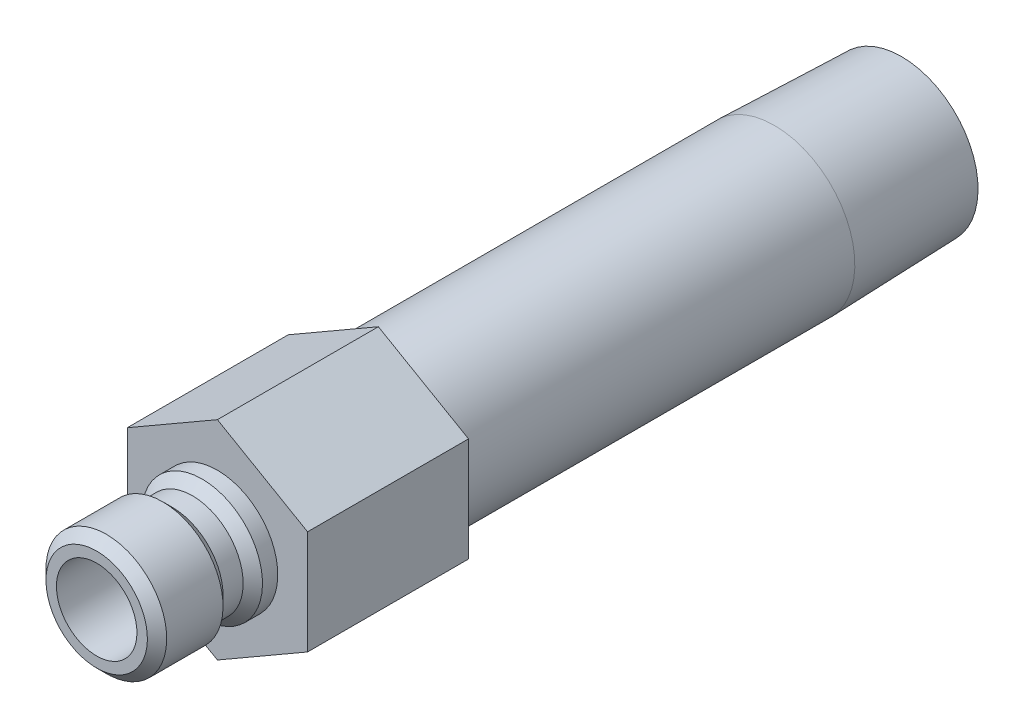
ISO-10303-21;
HEADER;
FILE_DESCRIPTION(('STEP AP214'),'2;1');
FILE_NAME('part.step','',(''),(''),'','','');
FILE_SCHEMA(('AUTOMOTIVE_DESIGN { 1 0 10303 214 1 1 1 1 }'));
ENDSEC;
DATA;
#1=APPLICATION_CONTEXT('core data for automotive mechanical design processes');
#2=APPLICATION_PROTOCOL_DEFINITION('international standard','automotive_design',2000,#1);
#3=PRODUCT_CONTEXT('',#1,'mechanical');
#4=PRODUCT('Part','Part','',(#3));
#5=PRODUCT_RELATED_PRODUCT_CATEGORY('part','',(#4));
#6=PRODUCT_DEFINITION_FORMATION('','',#4);
#7=PRODUCT_DEFINITION_CONTEXT('part definition',#1,'design');
#8=PRODUCT_DEFINITION('design','',#6,#7);
#9=PRODUCT_DEFINITION_SHAPE('','',#8);
#10=(LENGTH_UNIT() NAMED_UNIT(*) SI_UNIT(.MILLI.,.METRE.));
#11=(NAMED_UNIT(*) PLANE_ANGLE_UNIT() SI_UNIT($,.RADIAN.));
#12=(NAMED_UNIT(*) SI_UNIT($,.STERADIAN.) SOLID_ANGLE_UNIT());
#13=UNCERTAINTY_MEASURE_WITH_UNIT(LENGTH_MEASURE(1.E-05),#10,'distance_accuracy_value','');
#14=(GEOMETRIC_REPRESENTATION_CONTEXT(3) GLOBAL_UNCERTAINTY_ASSIGNED_CONTEXT((#13)) GLOBAL_UNIT_ASSIGNED_CONTEXT((#10,
#11,#12)) REPRESENTATION_CONTEXT('',''));
#15=CARTESIAN_POINT('',(0.,0.,0.));
#16=DIRECTION('',(0.,0.,1.));
#17=DIRECTION('',(1.,0.,0.));
#18=AXIS2_PLACEMENT_3D('',#15,#16,#17);
#19=CARTESIAN_POINT('',(0.,0.,0.));
#20=DIRECTION('',(0.,0.,-1.));
#21=DIRECTION('',(0.,1.,0.));
#22=AXIS2_PLACEMENT_3D('',#19,#20,#21);
#23=CYLINDRICAL_SURFACE('',#22,6.35);
#24=CARTESIAN_POINT('',(0.,0.,-43.942));
#25=DIRECTION('',(0.,0.,-1.));
#26=DIRECTION('',(0.,1.,0.));
#27=AXIS2_PLACEMENT_3D('',#24,#25,#26);
#28=CIRCLE('',#27,6.34999999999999);
#29=CARTESIAN_POINT('',(0.,6.35,-43.942));
#30=VERTEX_POINT('',#29);
#31=EDGE_CURVE('E42',#30,#30,#28,.T.);
#32=ORIENTED_EDGE('',*,*,#31,.F.);
#33=EDGE_LOOP('',(#32));
#34=FACE_BOUND('',#33,.T.);
#35=CARTESIAN_POINT('',(0.,0.,-12.7));
#36=DIRECTION('',(0.,0.,1.));
#37=DIRECTION('',(1.,0.,0.));
#38=AXIS2_PLACEMENT_3D('',#35,#36,#37);
#39=CIRCLE('',#38,6.35);
#40=CARTESIAN_POINT('',(6.35,0.,-12.7));
#41=VERTEX_POINT('',#40);
#42=EDGE_CURVE('E138',#41,#41,#39,.F.);
#43=ORIENTED_EDGE('',*,*,#42,.T.);
#44=EDGE_LOOP('',(#43));
#45=FACE_BOUND('',#44,.T.);
#46=ADVANCED_FACE('F33',(#34,#45),#23,.T.);
#47=CARTESIAN_POINT('',(0.,6.03647060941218,-53.975));
#48=DIRECTION('',(0.,0.,-1.));
#49=DIRECTION('',(0.,1.,0.));
#50=AXIS2_PLACEMENT_3D('',#47,#48,#49);
#51=PLANE('',#50);
#52=CARTESIAN_POINT('',(0.,0.,-53.975));
#53=DIRECTION('',(0.,0.,-1.));
#54=DIRECTION('',(0.,1.,0.));
#55=AXIS2_PLACEMENT_3D('',#52,#53,#54);
#56=CIRCLE('',#55,6.03647060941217);
#57=CARTESIAN_POINT('',(0.,6.03647060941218,-53.975));
#58=VERTEX_POINT('',#57);
#59=EDGE_CURVE('E11',#58,#58,#56,.T.);
#60=ORIENTED_EDGE('',*,*,#59,.T.);
#61=EDGE_LOOP('',(#60));
#62=FACE_BOUND('',#61,.T.);
#63=CARTESIAN_POINT('',(0.,0.,-53.975));
#64=DIRECTION('',(0.,0.,-1.));
#65=DIRECTION('',(0.,1.,0.));
#66=AXIS2_PLACEMENT_3D('',#63,#64,#65);
#67=CIRCLE('',#66,4.62279999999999);
#68=CARTESIAN_POINT('',(0.,4.6228,-53.975));
#69=VERTEX_POINT('',#68);
#70=EDGE_CURVE('E146',#69,#69,#67,.T.);
#71=ORIENTED_EDGE('',*,*,#70,.F.);
#72=EDGE_LOOP('',(#71));
#73=FACE_BOUND('',#72,.T.);
#74=ADVANCED_FACE('F35',(#62,#73),#51,.T.);
#75=CARTESIAN_POINT('',(0.,0.,-53.975));
#76=DIRECTION('',(0.,0.,1.));
#77=DIRECTION('',(0.,-1.,0.));
#78=AXIS2_PLACEMENT_3D('',#75,#76,#77);
#79=CONICAL_SURFACE('',#78,6.03647060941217,0.0312396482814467);
#80=ORIENTED_EDGE('',*,*,#31,.T.);
#81=EDGE_LOOP('',(#80));
#82=FACE_BOUND('',#81,.T.);
#83=ORIENTED_EDGE('',*,*,#59,.F.);
#84=EDGE_LOOP('',(#83));
#85=FACE_BOUND('',#84,.T.);
#86=ADVANCED_FACE('F181',(#82,#85),#79,.T.);
#87=CARTESIAN_POINT('',(0.,4.7625,0.));
#88=DIRECTION('',(0.,0.,1.));
#89=DIRECTION('',(0.,-1.,0.));
#90=AXIS2_PLACEMENT_3D('',#87,#88,#89);
#91=PLANE('',#90);
#92=CARTESIAN_POINT('',(0.,0.,0.));
#93=DIRECTION('',(0.,0.,-1.));
#94=DIRECTION('',(0.,1.,0.));
#95=AXIS2_PLACEMENT_3D('',#92,#93,#94);
#96=CIRCLE('',#95,4.7625);
#97=CARTESIAN_POINT('',(0.,4.7625,0.));
#98=VERTEX_POINT('',#97);
#99=EDGE_CURVE('E176',#98,#98,#96,.T.);
#100=ORIENTED_EDGE('',*,*,#99,.T.);
#101=EDGE_LOOP('',(#100));
#102=FACE_BOUND('',#101,.T.);
#103=DIRECTION('',(-0.866025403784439,-0.5,0.));
#104=VECTOR('',#103,1.);
#105=CARTESIAN_POINT('',(0.,8.21223022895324,0.));
#106=LINE('',#105,#104);
#107=CARTESIAN_POINT('',(0.,8.21223022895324,0.));
#108=VERTEX_POINT('',#107);
#109=CARTESIAN_POINT('',(-7.112,4.10611511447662,0.));
#110=VERTEX_POINT('',#109);
#111=EDGE_CURVE('E121',#108,#110,#106,.T.);
#112=ORIENTED_EDGE('',*,*,#111,.T.);
#113=DIRECTION('',(0.,-1.,0.));
#114=VECTOR('',#113,1.);
#115=CARTESIAN_POINT('',(-7.112,4.10611511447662,0.));
#116=LINE('',#115,#114);
#117=CARTESIAN_POINT('',(-7.112,-4.10611511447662,0.));
#118=VERTEX_POINT('',#117);
#119=EDGE_CURVE('E124',#110,#118,#116,.T.);
#120=ORIENTED_EDGE('',*,*,#119,.T.);
#121=DIRECTION('',(0.866025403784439,-0.5,0.));
#122=VECTOR('',#121,1.);
#123=CARTESIAN_POINT('',(-7.112,-4.10611511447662,0.));
#124=LINE('',#123,#122);
#125=CARTESIAN_POINT('',(0.,-8.21223022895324,0.));
#126=VERTEX_POINT('',#125);
#127=EDGE_CURVE('E127',#118,#126,#124,.T.);
#128=ORIENTED_EDGE('',*,*,#127,.T.);
#129=DIRECTION('',(0.866025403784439,0.5,0.));
#130=VECTOR('',#129,1.);
#131=CARTESIAN_POINT('',(0.,-8.21223022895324,0.));
#132=LINE('',#131,#130);
#133=CARTESIAN_POINT('',(7.112,-4.10611511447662,0.));
#134=VERTEX_POINT('',#133);
#135=EDGE_CURVE('E130',#126,#134,#132,.T.);
#136=ORIENTED_EDGE('',*,*,#135,.T.);
#137=DIRECTION('',(0.,1.,0.));
#138=VECTOR('',#137,1.);
#139=CARTESIAN_POINT('',(7.112,-4.10611511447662,0.));
#140=LINE('',#139,#138);
#141=CARTESIAN_POINT('',(7.112,4.10611511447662,0.));
#142=VERTEX_POINT('',#141);
#143=EDGE_CURVE('E98',#134,#142,#140,.T.);
#144=ORIENTED_EDGE('',*,*,#143,.T.);
#145=DIRECTION('',(-0.866025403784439,0.5,0.));
#146=VECTOR('',#145,1.);
#147=CARTESIAN_POINT('',(7.112,4.10611511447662,0.));
#148=LINE('',#147,#146);
#149=EDGE_CURVE('E133',#142,#108,#148,.T.);
#150=ORIENTED_EDGE('',*,*,#149,.T.);
#151=EDGE_LOOP('',(#112,#120,#128,#136,#144,#150));
#152=FACE_BOUND('',#151,.T.);
#153=ADVANCED_FACE('F250',(#102,#152),#91,.T.);
#154=CARTESIAN_POINT('',(0.,0.,0.));
#155=DIRECTION('',(0.,0.,-1.));
#156=DIRECTION('',(0.,1.,0.));
#157=AXIS2_PLACEMENT_3D('',#154,#155,#156);
#158=CYLINDRICAL_SURFACE('',#157,4.7625);
#159=CARTESIAN_POINT('',(0.,0.,1.2065));
#160=DIRECTION('',(0.,0.,-1.));
#161=DIRECTION('',(0.,1.,0.));
#162=AXIS2_PLACEMENT_3D('',#159,#160,#161);
#163=CIRCLE('',#162,4.7625);
#164=CARTESIAN_POINT('',(0.,4.7625,1.2065));
#165=VERTEX_POINT('',#164);
#166=EDGE_CURVE('E173',#165,#165,#163,.T.);
#167=ORIENTED_EDGE('',*,*,#166,.T.);
#168=EDGE_LOOP('',(#167));
#169=FACE_BOUND('',#168,.T.);
#170=ORIENTED_EDGE('',*,*,#99,.F.);
#171=EDGE_LOOP('',(#170));
#172=FACE_BOUND('',#171,.T.);
#173=ADVANCED_FACE('F246',(#169,#172),#158,.T.);
#174=CARTESIAN_POINT('',(0.,0.,1.2065));
#175=DIRECTION('',(0.,0.,-1.));
#176=DIRECTION('',(0.,1.,0.));
#177=AXIS2_PLACEMENT_3D('',#174,#175,#176);
#178=CONICAL_SURFACE('',#177,4.7625,0.785398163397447);
#179=CARTESIAN_POINT('',(0.,0.,1.9685));
#180=DIRECTION('',(0.,0.,-1.));
#181=DIRECTION('',(0.,1.,0.));
#182=AXIS2_PLACEMENT_3D('',#179,#180,#181);
#183=CIRCLE('',#182,4.0005);
#184=CARTESIAN_POINT('',(0.,4.0005,1.9685));
#185=VERTEX_POINT('',#184);
#186=EDGE_CURVE('E170',#185,#185,#183,.T.);
#187=ORIENTED_EDGE('',*,*,#186,.T.);
#188=EDGE_LOOP('',(#187));
#189=FACE_BOUND('',#188,.T.);
#190=ORIENTED_EDGE('',*,*,#166,.F.);
#191=EDGE_LOOP('',(#190));
#192=FACE_BOUND('',#191,.T.);
#193=ADVANCED_FACE('F242',(#189,#192),#178,.T.);
#194=CARTESIAN_POINT('',(0.,0.,0.));
#195=DIRECTION('',(0.,0.,-1.));
#196=DIRECTION('',(0.,1.,0.));
#197=AXIS2_PLACEMENT_3D('',#194,#195,#196);
#198=CYLINDRICAL_SURFACE('',#197,4.0005);
#199=CARTESIAN_POINT('',(0.,0.,3.556));
#200=DIRECTION('',(0.,0.,-1.));
#201=DIRECTION('',(0.,1.,0.));
#202=AXIS2_PLACEMENT_3D('',#199,#200,#201);
#203=CIRCLE('',#202,4.0005);
#204=CARTESIAN_POINT('',(0.,4.0005,3.556));
#205=VERTEX_POINT('',#204);
#206=EDGE_CURVE('E167',#205,#205,#203,.T.);
#207=ORIENTED_EDGE('',*,*,#206,.T.);
#208=EDGE_LOOP('',(#207));
#209=FACE_BOUND('',#208,.T.);
#210=ORIENTED_EDGE('',*,*,#186,.F.);
#211=EDGE_LOOP('',(#210));
#212=FACE_BOUND('',#211,.T.);
#213=ADVANCED_FACE('F238',(#209,#212),#198,.T.);
#214=CARTESIAN_POINT('',(0.,0.,3.556));
#215=DIRECTION('',(0.,0.,1.));
#216=DIRECTION('',(0.,-1.,0.));
#217=AXIS2_PLACEMENT_3D('',#214,#215,#216);
#218=CONICAL_SURFACE('',#217,4.0005,0.785398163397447);
#219=CARTESIAN_POINT('',(0.,0.,4.318));
#220=DIRECTION('',(0.,0.,-1.));
#221=DIRECTION('',(0.,1.,0.));
#222=AXIS2_PLACEMENT_3D('',#219,#220,#221);
#223=CIRCLE('',#222,4.7625);
#224=CARTESIAN_POINT('',(0.,4.7625,4.318));
#225=VERTEX_POINT('',#224);
#226=EDGE_CURVE('E164',#225,#225,#223,.T.);
#227=ORIENTED_EDGE('',*,*,#226,.T.);
#228=EDGE_LOOP('',(#227));
#229=FACE_BOUND('',#228,.T.);
#230=ORIENTED_EDGE('',*,*,#206,.F.);
#231=EDGE_LOOP('',(#230));
#232=FACE_BOUND('',#231,.T.);
#233=ADVANCED_FACE('F234',(#229,#232),#218,.T.);
#234=CARTESIAN_POINT('',(0.,0.,0.));
#235=DIRECTION('',(0.,0.,-1.));
#236=DIRECTION('',(0.,1.,0.));
#237=AXIS2_PLACEMENT_3D('',#234,#235,#236);
#238=CYLINDRICAL_SURFACE('',#237,4.7625);
#239=CARTESIAN_POINT('',(0.,0.,8.763));
#240=DIRECTION('',(0.,0.,-1.));
#241=DIRECTION('',(0.,1.,0.));
#242=AXIS2_PLACEMENT_3D('',#239,#240,#241);
#243=CIRCLE('',#242,4.7625);
#244=CARTESIAN_POINT('',(0.,4.7625,8.763));
#245=VERTEX_POINT('',#244);
#246=EDGE_CURVE('E161',#245,#245,#243,.T.);
#247=ORIENTED_EDGE('',*,*,#246,.T.);
#248=EDGE_LOOP('',(#247));
#249=FACE_BOUND('',#248,.T.);
#250=ORIENTED_EDGE('',*,*,#226,.F.);
#251=EDGE_LOOP('',(#250));
#252=FACE_BOUND('',#251,.T.);
#253=ADVANCED_FACE('F230',(#249,#252),#238,.T.);
#254=CARTESIAN_POINT('',(0.,0.,8.763));
#255=DIRECTION('',(0.,0.,-1.));
#256=DIRECTION('',(0.,1.,0.));
#257=AXIS2_PLACEMENT_3D('',#254,#255,#256);
#258=CONICAL_SURFACE('',#257,4.7625,0.785398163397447);
#259=CARTESIAN_POINT('',(0.,0.,9.525));
#260=DIRECTION('',(0.,0.,-1.));
#261=DIRECTION('',(0.,1.,0.));
#262=AXIS2_PLACEMENT_3D('',#259,#260,#261);
#263=CIRCLE('',#262,4.0005);
#264=CARTESIAN_POINT('',(0.,4.0005,9.525));
#265=VERTEX_POINT('',#264);
#266=EDGE_CURVE('E158',#265,#265,#263,.T.);
#267=ORIENTED_EDGE('',*,*,#266,.T.);
#268=EDGE_LOOP('',(#267));
#269=FACE_BOUND('',#268,.T.);
#270=ORIENTED_EDGE('',*,*,#246,.F.);
#271=EDGE_LOOP('',(#270));
#272=FACE_BOUND('',#271,.T.);
#273=ADVANCED_FACE('F226',(#269,#272),#258,.T.);
#274=CARTESIAN_POINT('',(0.,3.175,9.525));
#275=DIRECTION('',(0.,0.,1.));
#276=DIRECTION('',(0.,-1.,0.));
#277=AXIS2_PLACEMENT_3D('',#274,#275,#276);
#278=PLANE('',#277);
#279=CARTESIAN_POINT('',(0.,0.,9.525));
#280=DIRECTION('',(0.,0.,-1.));
#281=DIRECTION('',(0.,1.,0.));
#282=AXIS2_PLACEMENT_3D('',#279,#280,#281);
#283=CIRCLE('',#282,3.175);
#284=CARTESIAN_POINT('',(0.,3.175,9.525));
#285=VERTEX_POINT('',#284);
#286=EDGE_CURVE('E155',#285,#285,#283,.T.);
#287=ORIENTED_EDGE('',*,*,#286,.T.);
#288=EDGE_LOOP('',(#287));
#289=FACE_BOUND('',#288,.T.);
#290=ORIENTED_EDGE('',*,*,#266,.F.);
#291=EDGE_LOOP('',(#290));
#292=FACE_BOUND('',#291,.T.);
#293=ADVANCED_FACE('F222',(#289,#292),#278,.T.);
#294=CARTESIAN_POINT('',(0.,0.,0.));
#295=DIRECTION('',(0.,0.,-1.));
#296=DIRECTION('',(0.,1.,0.));
#297=AXIS2_PLACEMENT_3D('',#294,#295,#296);
#298=CYLINDRICAL_SURFACE('',#297,3.175);
#299=ORIENTED_EDGE('',*,*,#286,.F.);
#300=EDGE_LOOP('',(#299));
#301=FACE_BOUND('',#300,.T.);
#302=CARTESIAN_POINT('',(0.,0.,-12.7));
#303=DIRECTION('',(0.,0.,-1.));
#304=DIRECTION('',(0.,1.,0.));
#305=AXIS2_PLACEMENT_3D('',#302,#303,#304);
#306=CIRCLE('',#305,3.175);
#307=CARTESIAN_POINT('',(0.,3.175,-12.7));
#308=VERTEX_POINT('',#307);
#309=EDGE_CURVE('E152',#308,#308,#306,.T.);
#310=ORIENTED_EDGE('',*,*,#309,.T.);
#311=EDGE_LOOP('',(#310));
#312=FACE_BOUND('',#311,.T.);
#313=ADVANCED_FACE('F218',(#301,#312),#298,.F.);
#314=CARTESIAN_POINT('',(0.,4.6228,-12.7));
#315=DIRECTION('',(0.,0.,-1.));
#316=DIRECTION('',(0.,1.,0.));
#317=AXIS2_PLACEMENT_3D('',#314,#315,#316);
#318=PLANE('',#317);
#319=CARTESIAN_POINT('',(0.,0.,-12.7));
#320=DIRECTION('',(0.,0.,-1.));
#321=DIRECTION('',(0.,1.,0.));
#322=AXIS2_PLACEMENT_3D('',#319,#320,#321);
#323=CIRCLE('',#322,4.6228);
#324=CARTESIAN_POINT('',(0.,4.6228,-12.7));
#325=VERTEX_POINT('',#324);
#326=EDGE_CURVE('E149',#325,#325,#323,.T.);
#327=ORIENTED_EDGE('',*,*,#326,.T.);
#328=EDGE_LOOP('',(#327));
#329=FACE_BOUND('',#328,.T.);
#330=ORIENTED_EDGE('',*,*,#309,.F.);
#331=EDGE_LOOP('',(#330));
#332=FACE_BOUND('',#331,.T.);
#333=ADVANCED_FACE('F199',(#329,#332),#318,.T.);
#334=CARTESIAN_POINT('',(0.,0.,0.));
#335=DIRECTION('',(0.,0.,-1.));
#336=DIRECTION('',(0.,1.,0.));
#337=AXIS2_PLACEMENT_3D('',#334,#335,#336);
#338=CYLINDRICAL_SURFACE('',#337,4.6228);
#339=ORIENTED_EDGE('',*,*,#70,.T.);
#340=EDGE_LOOP('',(#339));
#341=FACE_BOUND('',#340,.T.);
#342=ORIENTED_EDGE('',*,*,#326,.F.);
#343=EDGE_LOOP('',(#342));
#344=FACE_BOUND('',#343,.T.);
#345=ADVANCED_FACE('F191',(#341,#344),#338,.F.);
#346=CARTESIAN_POINT('',(-7.112,4.10611511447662,-12.7));
#347=DIRECTION('',(0.,0.,1.));
#348=DIRECTION('',(1.,0.,0.));
#349=AXIS2_PLACEMENT_3D('',#346,#347,#348);
#350=PLANE('',#349);
#351=ORIENTED_EDGE('',*,*,#42,.F.);
#352=EDGE_LOOP('',(#351));
#353=FACE_BOUND('',#352,.T.);
#354=DIRECTION('',(-0.866025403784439,-0.5,0.));
#355=VECTOR('',#354,1.);
#356=CARTESIAN_POINT('',(0.,8.21223022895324,-12.7));
#357=LINE('',#356,#355);
#358=CARTESIAN_POINT('',(0.,8.21223022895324,-12.7));
#359=VERTEX_POINT('',#358);
#360=CARTESIAN_POINT('',(-7.112,4.10611511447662,-12.7));
#361=VERTEX_POINT('',#360);
#362=EDGE_CURVE('E136',#359,#361,#357,.T.);
#363=ORIENTED_EDGE('',*,*,#362,.F.);
#364=DIRECTION('',(-0.866025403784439,0.5,0.));
#365=VECTOR('',#364,1.);
#366=CARTESIAN_POINT('',(7.112,4.10611511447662,-12.7));
#367=LINE('',#366,#365);
#368=CARTESIAN_POINT('',(7.112,4.10611511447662,-12.7));
#369=VERTEX_POINT('',#368);
#370=EDGE_CURVE('E111',#369,#359,#367,.T.);
#371=ORIENTED_EDGE('',*,*,#370,.F.);
#372=DIRECTION('',(0.,1.,0.));
#373=VECTOR('',#372,1.);
#374=CARTESIAN_POINT('',(7.112,-4.10611511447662,-12.7));
#375=LINE('',#374,#373);
#376=CARTESIAN_POINT('',(7.112,-4.10611511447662,-12.7));
#377=VERTEX_POINT('',#376);
#378=EDGE_CURVE('E96',#377,#369,#375,.T.);
#379=ORIENTED_EDGE('',*,*,#378,.F.);
#380=DIRECTION('',(0.866025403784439,0.5,0.));
#381=VECTOR('',#380,1.);
#382=CARTESIAN_POINT('',(0.,-8.21223022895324,-12.7));
#383=LINE('',#382,#381);
#384=CARTESIAN_POINT('',(0.,-8.21223022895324,-12.7));
#385=VERTEX_POINT('',#384);
#386=EDGE_CURVE('E109',#385,#377,#383,.T.);
#387=ORIENTED_EDGE('',*,*,#386,.F.);
#388=DIRECTION('',(0.866025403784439,-0.5,0.));
#389=VECTOR('',#388,1.);
#390=CARTESIAN_POINT('',(-7.112,-4.10611511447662,-12.7));
#391=LINE('',#390,#389);
#392=CARTESIAN_POINT('',(-7.112,-4.10611511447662,-12.7));
#393=VERTEX_POINT('',#392);
#394=EDGE_CURVE('E114',#393,#385,#391,.T.);
#395=ORIENTED_EDGE('',*,*,#394,.F.);
#396=DIRECTION('',(0.,-1.,0.));
#397=VECTOR('',#396,1.);
#398=CARTESIAN_POINT('',(-7.112,4.10611511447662,-12.7));
#399=LINE('',#398,#397);
#400=EDGE_CURVE('E116',#361,#393,#399,.T.);
#401=ORIENTED_EDGE('',*,*,#400,.F.);
#402=EDGE_LOOP('',(#363,#371,#379,#387,#395,#401));
#403=FACE_BOUND('',#402,.T.);
#404=ADVANCED_FACE('F107',(#353,#403),#350,.F.);
#405=CARTESIAN_POINT('',(0.,8.21223022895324,-12.7));
#406=DIRECTION('',(-0.5,0.866025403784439,0.));
#407=DIRECTION('',(-0.866025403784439,-0.5,0.));
#408=AXIS2_PLACEMENT_3D('',#405,#406,#407);
#409=PLANE('',#408);
#410=ORIENTED_EDGE('',*,*,#111,.F.);
#411=DIRECTION('',(0.,0.,1.));
#412=VECTOR('',#411,1.);
#413=CARTESIAN_POINT('',(0.,8.21223022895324,-12.7));
#414=LINE('',#413,#412);
#415=EDGE_CURVE('E50',#359,#108,#414,.T.);
#416=ORIENTED_EDGE('',*,*,#415,.F.);
#417=ORIENTED_EDGE('',*,*,#362,.T.);
#418=DIRECTION('',(0.,0.,1.));
#419=VECTOR('',#418,1.);
#420=CARTESIAN_POINT('',(-7.112,4.10611511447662,-12.7));
#421=LINE('',#420,#419);
#422=EDGE_CURVE('E85',#361,#110,#421,.T.);
#423=ORIENTED_EDGE('',*,*,#422,.T.);
#424=EDGE_LOOP('',(#410,#416,#417,#423));
#425=FACE_BOUND('',#424,.T.);
#426=ADVANCED_FACE('F190',(#425),#409,.T.);
#427=CARTESIAN_POINT('',(7.112,4.10611511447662,-12.7));
#428=DIRECTION('',(0.5,0.866025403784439,0.));
#429=DIRECTION('',(-0.866025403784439,0.5,0.));
#430=AXIS2_PLACEMENT_3D('',#427,#428,#429);
#431=PLANE('',#430);
#432=ORIENTED_EDGE('',*,*,#149,.F.);
#433=DIRECTION('',(0.,0.,1.));
#434=VECTOR('',#433,1.);
#435=CARTESIAN_POINT('',(7.112,4.10611511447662,-12.7));
#436=LINE('',#435,#434);
#437=EDGE_CURVE('E73',#369,#142,#436,.T.);
#438=ORIENTED_EDGE('',*,*,#437,.F.);
#439=ORIENTED_EDGE('',*,*,#370,.T.);
#440=ORIENTED_EDGE('',*,*,#415,.T.);
#441=EDGE_LOOP('',(#432,#438,#439,#440));
#442=FACE_BOUND('',#441,.T.);
#443=ADVANCED_FACE('F197',(#442),#431,.T.);
#444=CARTESIAN_POINT('',(7.112,-4.10611511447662,-12.7));
#445=DIRECTION('',(1.,0.,0.));
#446=DIRECTION('',(0.,1.,0.));
#447=AXIS2_PLACEMENT_3D('',#444,#445,#446);
#448=PLANE('',#447);
#449=ORIENTED_EDGE('',*,*,#143,.F.);
#450=DIRECTION('',(0.,0.,1.));
#451=VECTOR('',#450,1.);
#452=CARTESIAN_POINT('',(7.112,-4.10611511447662,-12.7));
#453=LINE('',#452,#451);
#454=EDGE_CURVE('E93',#377,#134,#453,.T.);
#455=ORIENTED_EDGE('',*,*,#454,.F.);
#456=ORIENTED_EDGE('',*,*,#378,.T.);
#457=ORIENTED_EDGE('',*,*,#437,.T.);
#458=EDGE_LOOP('',(#449,#455,#456,#457));
#459=FACE_BOUND('',#458,.T.);
#460=ADVANCED_FACE('F95',(#459),#448,.T.);
#461=CARTESIAN_POINT('',(0.,-8.21223022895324,-12.7));
#462=DIRECTION('',(0.5,-0.866025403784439,0.));
#463=DIRECTION('',(0.866025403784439,0.5,0.));
#464=AXIS2_PLACEMENT_3D('',#461,#462,#463);
#465=PLANE('',#464);
#466=ORIENTED_EDGE('',*,*,#135,.F.);
#467=DIRECTION('',(0.,0.,1.));
#468=VECTOR('',#467,1.);
#469=CARTESIAN_POINT('',(0.,-8.21223022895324,-12.7));
#470=LINE('',#469,#468);
#471=EDGE_CURVE('E103',#385,#126,#470,.T.);
#472=ORIENTED_EDGE('',*,*,#471,.F.);
#473=ORIENTED_EDGE('',*,*,#386,.T.);
#474=ORIENTED_EDGE('',*,*,#454,.T.);
#475=EDGE_LOOP('',(#466,#472,#473,#474));
#476=FACE_BOUND('',#475,.T.);
#477=ADVANCED_FACE('F113',(#476),#465,.T.);
#478=CARTESIAN_POINT('',(-7.112,-4.10611511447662,-12.7));
#479=DIRECTION('',(-0.5,-0.866025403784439,0.));
#480=DIRECTION('',(0.866025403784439,-0.5,0.));
#481=AXIS2_PLACEMENT_3D('',#478,#479,#480);
#482=PLANE('',#481);
#483=ORIENTED_EDGE('',*,*,#127,.F.);
#484=DIRECTION('',(0.,0.,1.));
#485=VECTOR('',#484,1.);
#486=CARTESIAN_POINT('',(-7.112,-4.10611511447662,-12.7));
#487=LINE('',#486,#485);
#488=EDGE_CURVE('E141',#393,#118,#487,.T.);
#489=ORIENTED_EDGE('',*,*,#488,.F.);
#490=ORIENTED_EDGE('',*,*,#394,.T.);
#491=ORIENTED_EDGE('',*,*,#471,.T.);
#492=EDGE_LOOP('',(#483,#489,#490,#491));
#493=FACE_BOUND('',#492,.T.);
#494=ADVANCED_FACE('F209',(#493),#482,.T.);
#495=CARTESIAN_POINT('',(-7.112,4.10611511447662,-12.7));
#496=DIRECTION('',(-1.,0.,0.));
#497=DIRECTION('',(0.,0.,1.));
#498=AXIS2_PLACEMENT_3D('',#495,#496,#497);
#499=PLANE('',#498);
#500=ORIENTED_EDGE('',*,*,#119,.F.);
#501=ORIENTED_EDGE('',*,*,#422,.F.);
#502=ORIENTED_EDGE('',*,*,#400,.T.);
#503=ORIENTED_EDGE('',*,*,#488,.T.);
#504=EDGE_LOOP('',(#500,#501,#502,#503));
#505=FACE_BOUND('',#504,.T.);
#506=ADVANCED_FACE('F212',(#505),#499,.T.);
#507=CLOSED_SHELL('',(#46,#74,#86,#153,#173,#193,#213,#233,#253,#273,#293,#313,#333,#345,#404,
#426,#443,#460,#477,#494,#506));
#508=MANIFOLD_SOLID_BREP('B2',#507);
#509=ADVANCED_BREP_SHAPE_REPRESENTATION('',(#18,#508),#14);
#510=SHAPE_DEFINITION_REPRESENTATION(#9,#509);
ENDSEC;
END-ISO-10303-21;
